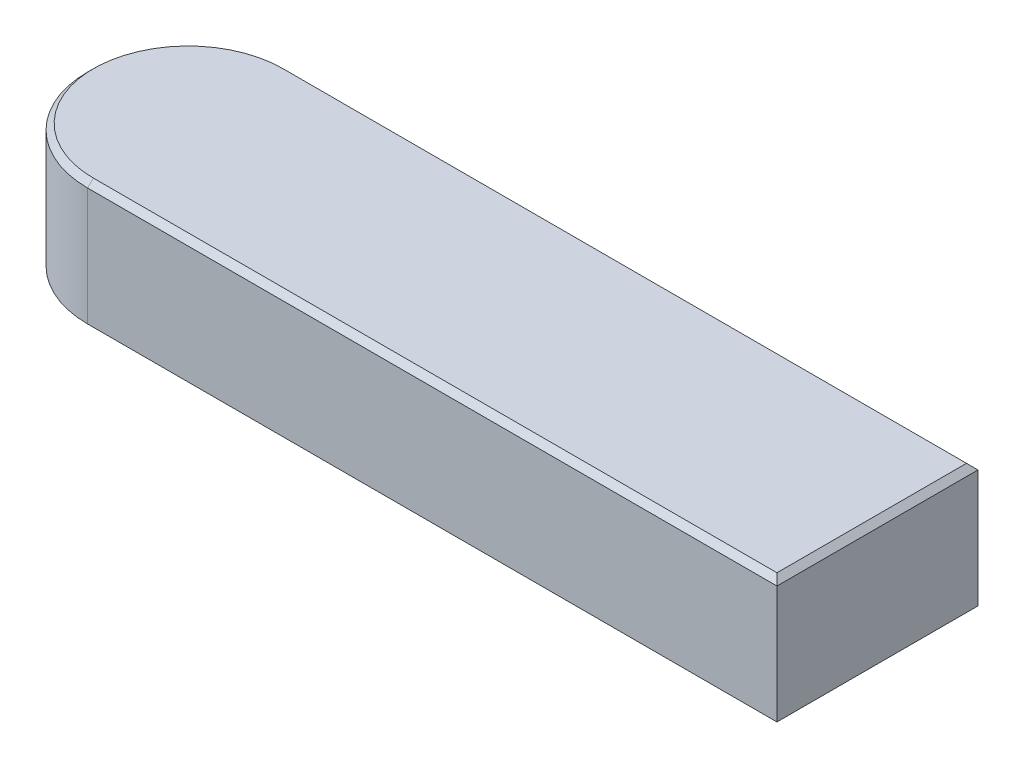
from build123d import *

# Parameters (mm, degrees)
BASE_EXTRUSION_DEPTH = 9
CHANFREIN1_SIZE      = 0.4


with BuildPart() as part:
    # Esquisse1 → Base-Extrusion (new body)
    with BuildSketch(Plane(origin=(0, 0, 0), x_dir=(1, 0, 0), z_dir=(0, 1, 0))):
        with BuildLine():
            Line((48, 7), (0, 7))
            ThreePointArc((0, 7), (-7, 0), (0, -7))
            Line((0, -7), (48, -7))
            Line((48, -7), (48, 7))
        make_face()
    extrude(amount=BASE_EXTRUSION_DEPTH)

    # Chanfrein1
    chanfrein1_edges = [part.edges().sort_by_distance(p)[0] for p in [
        (48, 9, 0),
        (24, 9, -7),
        (-7, 9, 0),
        (24, 0, -7),
        (48, 0, 0),
        (24, 0, 7),
        (-7, 0, 0),
        (24, 9, 7),
    ]]
    chamfer(chanfrein1_edges, length=CHANFREIN1_SIZE)


solid = part.part
